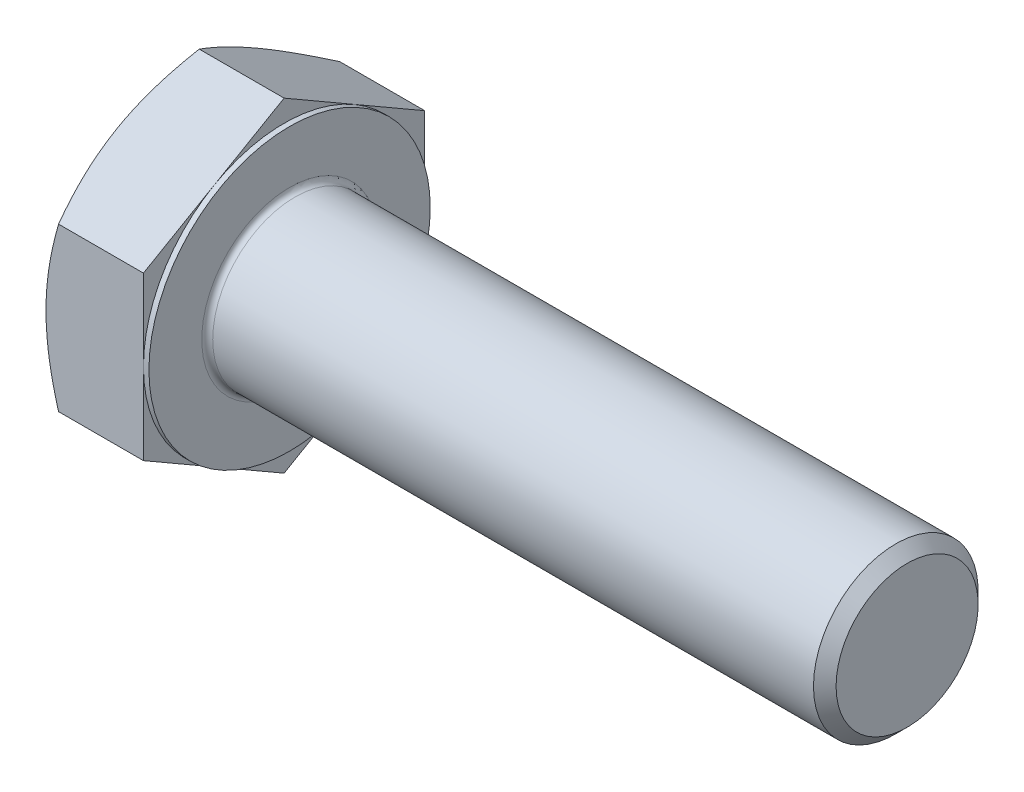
from build123d import *

# Parameters (mm, degrees)
BASEHEAD_DEPTH   = 15
BEARINGFACESKE_W = 0.8
BEARINGFACESKE_H = 3.171361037
FILLET_2_R       = 0.8


with BuildPart() as part:
    # BaseHeadSke → BaseHead (new body)
    with BuildSketch(Plane(origin=(0, 0, 0), x_dir=(0, 0, -1), z_dir=(1, 0, 0))):
        Polygon((20.5, 11.835680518), (0, 23.671361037), (-20.5, 11.835680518), (-20.5, -11.835680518), (0, -23.671361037), (20.5, -11.835680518), align=None)
    extrude(amount=BASEHEAD_DEPTH)

    # BodySke → BaseBody (revolve)
    with BuildSketch(Plane.XY, mode=Mode.PRIVATE) as basebody_sk:
        Polygon((0, 0), (105, 0), (105, 10.352), (103.352, 12), (0, 12), align=None)
    revolve(basebody_sk.sketch.rotate(Axis((0, 0, 0), (1, 0, 0)), 90), axis=Axis((0, 0, 0), (1, 0, 0)))

    # HeadChamferSke → HeadChamfer (revolve, cut)
    with BuildSketch(Plane.XY):
        Polygon((1.830986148, 23.671361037), (0, 23.671361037), (0, 20.5), align=None)
    revolve(axis=Axis((0, 0, 0), (1, 0, 0)), mode=Mode.SUBTRACT)

    # BearingFaceSke → BearingFace (revolve, cut)
    with BuildSketch(Plane.XY, mode=Mode.PRIVATE) as bearingface_sk:
        with Locations((14.6, 22.085680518)):
            Rectangle(BEARINGFACESKE_W, BEARINGFACESKE_H)
    revolve(bearingface_sk.sketch.rotate(Axis((0, 0, 0), (1, 0, 0)), 270), axis=Axis((0, 0, 0), (1, 0, 0)), mode=Mode.SUBTRACT)

    # Fillet 2
    fillet_2_edges = [part.edges().sort_by_distance(p)[0] for p in [
        (15, 0, -12),
    ]]
    fillet(fillet_2_edges, radius=FILLET_2_R)


solid = part.part
